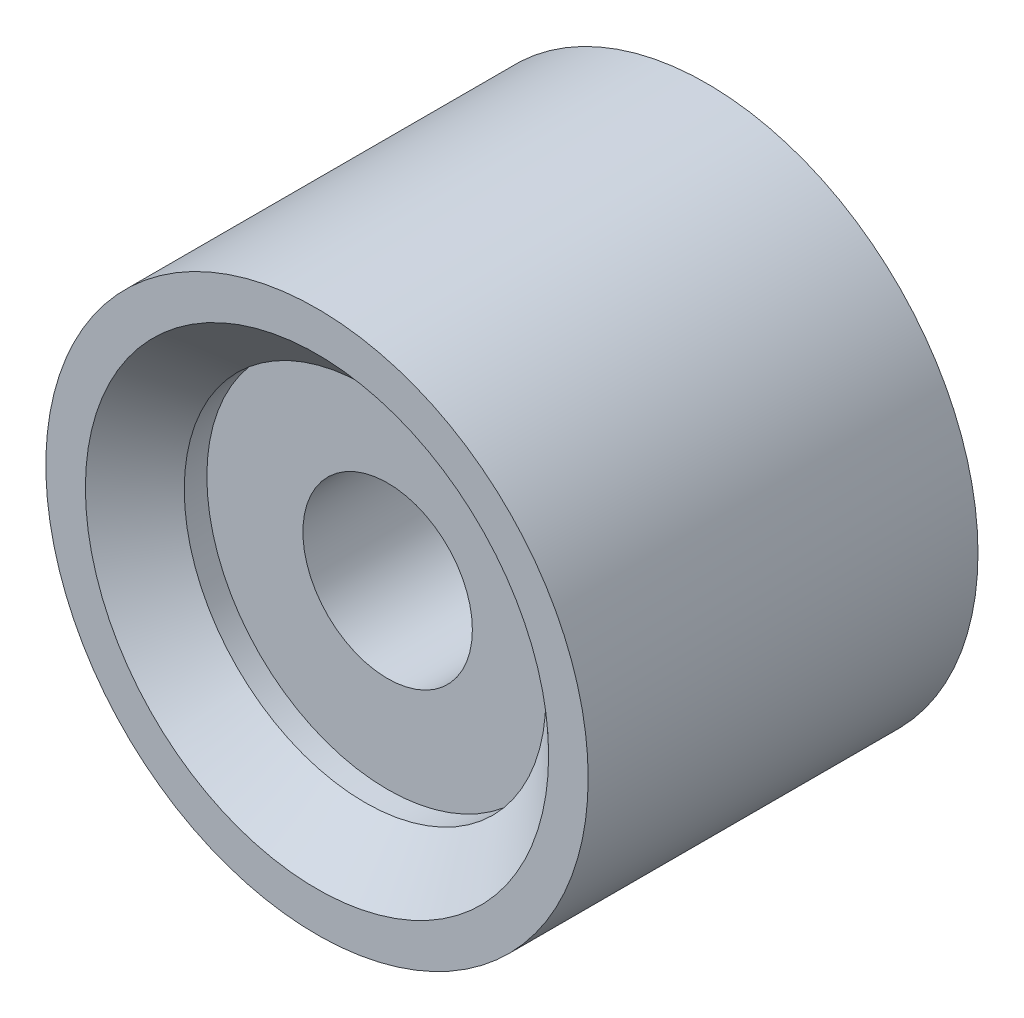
ISO-10303-21;
HEADER;
FILE_DESCRIPTION(('STEP AP214'),'2;1');
FILE_NAME('part.step','',(''),(''),'','','');
FILE_SCHEMA(('AUTOMOTIVE_DESIGN { 1 0 10303 214 1 1 1 1 }'));
ENDSEC;
DATA;
#1=APPLICATION_CONTEXT('core data for automotive mechanical design processes');
#2=APPLICATION_PROTOCOL_DEFINITION('international standard','automotive_design',2000,#1);
#3=PRODUCT_CONTEXT('',#1,'mechanical');
#4=PRODUCT('Part','Part','',(#3));
#5=PRODUCT_RELATED_PRODUCT_CATEGORY('part','',(#4));
#6=PRODUCT_DEFINITION_FORMATION('','',#4);
#7=PRODUCT_DEFINITION_CONTEXT('part definition',#1,'design');
#8=PRODUCT_DEFINITION('design','',#6,#7);
#9=PRODUCT_DEFINITION_SHAPE('','',#8);
#10=(LENGTH_UNIT() NAMED_UNIT(*) SI_UNIT(.MILLI.,.METRE.));
#11=(NAMED_UNIT(*) PLANE_ANGLE_UNIT() SI_UNIT($,.RADIAN.));
#12=(NAMED_UNIT(*) SI_UNIT($,.STERADIAN.) SOLID_ANGLE_UNIT());
#13=UNCERTAINTY_MEASURE_WITH_UNIT(LENGTH_MEASURE(1.E-05),#10,'distance_accuracy_value','');
#14=(GEOMETRIC_REPRESENTATION_CONTEXT(3) GLOBAL_UNCERTAINTY_ASSIGNED_CONTEXT((#13)) GLOBAL_UNIT_ASSIGNED_CONTEXT((#10,
#11,#12)) REPRESENTATION_CONTEXT('',''));
#15=CARTESIAN_POINT('',(0.,0.,0.));
#16=DIRECTION('',(0.,0.,1.));
#17=DIRECTION('',(1.,0.,0.));
#18=AXIS2_PLACEMENT_3D('',#15,#16,#17);
#19=CARTESIAN_POINT('',(0.,-30.,17.25));
#20=DIRECTION('',(0.,0.,1.));
#21=DIRECTION('',(-1.,0.,0.));
#22=AXIS2_PLACEMENT_3D('',#19,#20,#21);
#23=PLANE('',#22);
#24=CARTESIAN_POINT('',(0.,0.,17.25));
#25=DIRECTION('',(0.,0.,-1.));
#26=DIRECTION('',(1.,0.,0.));
#27=AXIS2_PLACEMENT_3D('',#24,#25,#26);
#28=CIRCLE('',#27,20.5);
#29=CARTESIAN_POINT('',(20.5,0.,17.25));
#30=VERTEX_POINT('',#29);
#31=EDGE_CURVE('E32',#30,#30,#28,.T.);
#32=ORIENTED_EDGE('',*,*,#31,.T.);
#33=EDGE_LOOP('',(#32));
#34=FACE_BOUND('',#33,.T.);
#35=CARTESIAN_POINT('',(0.,0.,17.25));
#36=DIRECTION('',(0.,0.,1.));
#37=DIRECTION('',(1.,0.,0.));
#38=AXIS2_PLACEMENT_3D('',#35,#36,#37);
#39=CIRCLE('',#38,24.);
#40=CARTESIAN_POINT('',(24.,0.,17.25));
#41=VERTEX_POINT('',#40);
#42=EDGE_CURVE('E45',#41,#41,#39,.T.);
#43=ORIENTED_EDGE('',*,*,#42,.T.);
#44=EDGE_LOOP('',(#43));
#45=FACE_BOUND('',#44,.T.);
#46=ADVANCED_FACE('F12',(#34,#45),#23,.T.);
#47=CARTESIAN_POINT('',(0.,-30.,-17.25));
#48=DIRECTION('',(0.,0.,1.));
#49=DIRECTION('',(-1.,0.,0.));
#50=AXIS2_PLACEMENT_3D('',#47,#48,#49);
#51=PLANE('',#50);
#52=CARTESIAN_POINT('',(0.,0.,-17.25));
#53=DIRECTION('',(0.,0.,-1.));
#54=DIRECTION('',(1.,0.,0.));
#55=AXIS2_PLACEMENT_3D('',#52,#53,#54);
#56=CIRCLE('',#55,20.5);
#57=CARTESIAN_POINT('',(20.5,0.,-17.25));
#58=VERTEX_POINT('',#57);
#59=EDGE_CURVE('E35',#58,#58,#56,.T.);
#60=ORIENTED_EDGE('',*,*,#59,.F.);
#61=EDGE_LOOP('',(#60));
#62=FACE_BOUND('',#61,.T.);
#63=CARTESIAN_POINT('',(0.,0.,-17.25));
#64=DIRECTION('',(0.,0.,1.));
#65=DIRECTION('',(1.,0.,0.));
#66=AXIS2_PLACEMENT_3D('',#63,#64,#65);
#67=CIRCLE('',#66,24.);
#68=CARTESIAN_POINT('',(24.,0.,-17.25));
#69=VERTEX_POINT('',#68);
#70=EDGE_CURVE('E44',#69,#69,#67,.T.);
#71=ORIENTED_EDGE('',*,*,#70,.F.);
#72=EDGE_LOOP('',(#71));
#73=FACE_BOUND('',#72,.T.);
#74=ADVANCED_FACE('F54',(#62,#73),#51,.F.);
#75=CARTESIAN_POINT('',(0.,-7.5,-11.));
#76=DIRECTION('',(0.,0.,-1.));
#77=DIRECTION('',(1.,0.,0.));
#78=AXIS2_PLACEMENT_3D('',#75,#76,#77);
#79=PLANE('',#78);
#80=CARTESIAN_POINT('',(0.,0.,-11.));
#81=DIRECTION('',(0.,0.,-1.));
#82=DIRECTION('',(1.,0.,0.));
#83=AXIS2_PLACEMENT_3D('',#80,#81,#82);
#84=CIRCLE('',#83,16.);
#85=CARTESIAN_POINT('',(16.,0.,-11.));
#86=VERTEX_POINT('',#85);
#87=EDGE_CURVE('E41',#86,#86,#84,.T.);
#88=ORIENTED_EDGE('',*,*,#87,.T.);
#89=EDGE_LOOP('',(#88));
#90=FACE_BOUND('',#89,.T.);
#91=CARTESIAN_POINT('',(0.,0.,-11.));
#92=DIRECTION('',(0.,0.,-1.));
#93=DIRECTION('',(1.,0.,0.));
#94=AXIS2_PLACEMENT_3D('',#91,#92,#93);
#95=CIRCLE('',#94,7.5);
#96=CARTESIAN_POINT('',(7.5,0.,-11.));
#97=VERTEX_POINT('',#96);
#98=EDGE_CURVE('E8',#97,#97,#95,.T.);
#99=ORIENTED_EDGE('',*,*,#98,.F.);
#100=EDGE_LOOP('',(#99));
#101=FACE_BOUND('',#100,.T.);
#102=ADVANCED_FACE('F14',(#90,#101),#79,.T.);
#103=CARTESIAN_POINT('',(0.,0.,-20.));
#104=DIRECTION('',(0.,0.,-1.));
#105=DIRECTION('',(1.,0.,0.));
#106=AXIS2_PLACEMENT_3D('',#103,#104,#105);
#107=CYLINDRICAL_SURFACE('',#106,7.5);
#108=ORIENTED_EDGE('',*,*,#98,.T.);
#109=EDGE_LOOP('',(#108));
#110=FACE_BOUND('',#109,.T.);
#111=CARTESIAN_POINT('',(0.,0.,11.));
#112=DIRECTION('',(0.,0.,-1.));
#113=DIRECTION('',(1.,0.,0.));
#114=AXIS2_PLACEMENT_3D('',#111,#112,#113);
#115=CIRCLE('',#114,7.5);
#116=CARTESIAN_POINT('',(7.5,0.,11.));
#117=VERTEX_POINT('',#116);
#118=EDGE_CURVE('E19',#117,#117,#115,.T.);
#119=ORIENTED_EDGE('',*,*,#118,.F.);
#120=EDGE_LOOP('',(#119));
#121=FACE_BOUND('',#120,.T.);
#122=ADVANCED_FACE('F64',(#110,#121),#107,.F.);
#123=CARTESIAN_POINT('',(0.,-7.5,11.));
#124=DIRECTION('',(0.,0.,-1.));
#125=DIRECTION('',(1.,0.,0.));
#126=AXIS2_PLACEMENT_3D('',#123,#124,#125);
#127=PLANE('',#126);
#128=CARTESIAN_POINT('',(0.,0.,11.));
#129=DIRECTION('',(0.,0.,-1.));
#130=DIRECTION('',(1.,0.,0.));
#131=AXIS2_PLACEMENT_3D('',#128,#129,#130);
#132=CIRCLE('',#131,16.);
#133=CARTESIAN_POINT('',(16.,0.,11.));
#134=VERTEX_POINT('',#133);
#135=EDGE_CURVE('E23',#134,#134,#132,.T.);
#136=ORIENTED_EDGE('',*,*,#135,.F.);
#137=EDGE_LOOP('',(#136));
#138=FACE_BOUND('',#137,.T.);
#139=ORIENTED_EDGE('',*,*,#118,.T.);
#140=EDGE_LOOP('',(#139));
#141=FACE_BOUND('',#140,.T.);
#142=ADVANCED_FACE('F80',(#138,#141),#127,.F.);
#143=CARTESIAN_POINT('',(0.,0.,-20.));
#144=DIRECTION('',(0.,0.,-1.));
#145=DIRECTION('',(1.,0.,0.));
#146=AXIS2_PLACEMENT_3D('',#143,#144,#145);
#147=CYLINDRICAL_SURFACE('',#146,16.);
#148=CARTESIAN_POINT('',(0.,0.,13.));
#149=DIRECTION('',(0.,0.,-1.));
#150=DIRECTION('',(1.,0.,0.));
#151=AXIS2_PLACEMENT_3D('',#148,#149,#150);
#152=CIRCLE('',#151,16.);
#153=CARTESIAN_POINT('',(16.,0.,13.));
#154=VERTEX_POINT('',#153);
#155=EDGE_CURVE('E27',#154,#154,#152,.T.);
#156=ORIENTED_EDGE('',*,*,#155,.F.);
#157=EDGE_LOOP('',(#156));
#158=FACE_BOUND('',#157,.T.);
#159=ORIENTED_EDGE('',*,*,#135,.T.);
#160=EDGE_LOOP('',(#159));
#161=FACE_BOUND('',#160,.T.);
#162=ADVANCED_FACE('F76',(#158,#161),#147,.F.);
#163=CARTESIAN_POINT('',(0.,0.,13.));
#164=DIRECTION('',(0.,0.,1.));
#165=DIRECTION('',(-1.,0.,0.));
#166=AXIS2_PLACEMENT_3D('',#163,#164,#165);
#167=CONICAL_SURFACE('',#166,16.,0.813961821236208);
#168=ORIENTED_EDGE('',*,*,#31,.F.);
#169=EDGE_LOOP('',(#168));
#170=FACE_BOUND('',#169,.T.);
#171=ORIENTED_EDGE('',*,*,#155,.T.);
#172=EDGE_LOOP('',(#171));
#173=FACE_BOUND('',#172,.T.);
#174=ADVANCED_FACE('F73',(#170,#173),#167,.F.);
#175=CARTESIAN_POINT('',(0.,0.,-13.));
#176=DIRECTION('',(0.,0.,-1.));
#177=DIRECTION('',(1.,0.,0.));
#178=AXIS2_PLACEMENT_3D('',#175,#176,#177);
#179=CONICAL_SURFACE('',#178,16.,0.813961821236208);
#180=ORIENTED_EDGE('',*,*,#59,.T.);
#181=EDGE_LOOP('',(#180));
#182=FACE_BOUND('',#181,.T.);
#183=CARTESIAN_POINT('',(0.,0.,-13.));
#184=DIRECTION('',(0.,0.,-1.));
#185=DIRECTION('',(1.,0.,0.));
#186=AXIS2_PLACEMENT_3D('',#183,#184,#185);
#187=CIRCLE('',#186,16.);
#188=CARTESIAN_POINT('',(16.,0.,-13.));
#189=VERTEX_POINT('',#188);
#190=EDGE_CURVE('E38',#189,#189,#187,.T.);
#191=ORIENTED_EDGE('',*,*,#190,.F.);
#192=EDGE_LOOP('',(#191));
#193=FACE_BOUND('',#192,.T.);
#194=ADVANCED_FACE('F70',(#182,#193),#179,.F.);
#195=CARTESIAN_POINT('',(0.,0.,-20.));
#196=DIRECTION('',(0.,0.,-1.));
#197=DIRECTION('',(1.,0.,0.));
#198=AXIS2_PLACEMENT_3D('',#195,#196,#197);
#199=CYLINDRICAL_SURFACE('',#198,16.);
#200=ORIENTED_EDGE('',*,*,#190,.T.);
#201=EDGE_LOOP('',(#200));
#202=FACE_BOUND('',#201,.T.);
#203=ORIENTED_EDGE('',*,*,#87,.F.);
#204=EDGE_LOOP('',(#203));
#205=FACE_BOUND('',#204,.T.);
#206=ADVANCED_FACE('F118',(#202,#205),#199,.F.);
#207=CARTESIAN_POINT('',(0.,0.,-17.25));
#208=DIRECTION('',(0.,0.,1.));
#209=DIRECTION('',(1.,0.,0.));
#210=AXIS2_PLACEMENT_3D('',#207,#208,#209);
#211=CYLINDRICAL_SURFACE('',#210,24.);
#212=ORIENTED_EDGE('',*,*,#70,.T.);
#213=EDGE_LOOP('',(#212));
#214=FACE_BOUND('',#213,.T.);
#215=ORIENTED_EDGE('',*,*,#42,.F.);
#216=EDGE_LOOP('',(#215));
#217=FACE_BOUND('',#216,.T.);
#218=ADVANCED_FACE('F51',(#214,#217),#211,.T.);
#219=CLOSED_SHELL('',(#46,#74,#102,#122,#142,#162,#174,#194,#206,#218));
#220=MANIFOLD_SOLID_BREP('B1',#219);
#221=ADVANCED_BREP_SHAPE_REPRESENTATION('',(#18,#220),#14);
#222=SHAPE_DEFINITION_REPRESENTATION(#9,#221);
ENDSEC;
END-ISO-10303-21;
